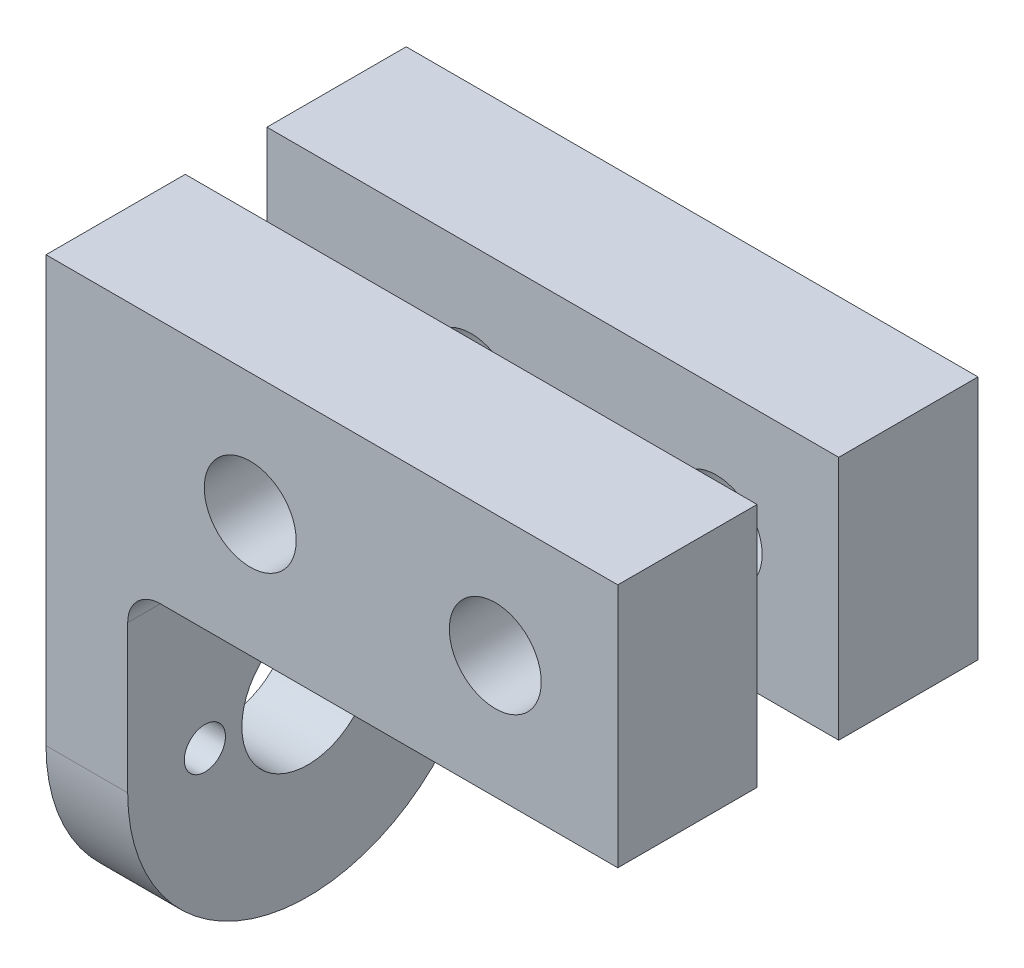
ISO-10303-21;
HEADER;
FILE_DESCRIPTION(('STEP AP214'),'2;1');
FILE_NAME('part.step','',(''),(''),'','','');
FILE_SCHEMA(('AUTOMOTIVE_DESIGN { 1 0 10303 214 1 1 1 1 }'));
ENDSEC;
DATA;
#1=APPLICATION_CONTEXT('core data for automotive mechanical design processes');
#2=APPLICATION_PROTOCOL_DEFINITION('international standard','automotive_design',2000,#1);
#3=PRODUCT_CONTEXT('',#1,'mechanical');
#4=PRODUCT('Part','Part','',(#3));
#5=PRODUCT_RELATED_PRODUCT_CATEGORY('part','',(#4));
#6=PRODUCT_DEFINITION_FORMATION('','',#4);
#7=PRODUCT_DEFINITION_CONTEXT('part definition',#1,'design');
#8=PRODUCT_DEFINITION('design','',#6,#7);
#9=PRODUCT_DEFINITION_SHAPE('','',#8);
#10=(LENGTH_UNIT() NAMED_UNIT(*) SI_UNIT(.MILLI.,.METRE.));
#11=(NAMED_UNIT(*) PLANE_ANGLE_UNIT() SI_UNIT($,.RADIAN.));
#12=(NAMED_UNIT(*) SI_UNIT($,.STERADIAN.) SOLID_ANGLE_UNIT());
#13=UNCERTAINTY_MEASURE_WITH_UNIT(LENGTH_MEASURE(1.E-05),#10,'distance_accuracy_value','');
#14=(GEOMETRIC_REPRESENTATION_CONTEXT(3) GLOBAL_UNCERTAINTY_ASSIGNED_CONTEXT((#13)) GLOBAL_UNIT_ASSIGNED_CONTEXT((#10,
#11,#12)) REPRESENTATION_CONTEXT('',''));
#15=CARTESIAN_POINT('',(0.,0.,0.));
#16=DIRECTION('',(0.,0.,1.));
#17=DIRECTION('',(1.,0.,0.));
#18=AXIS2_PLACEMENT_3D('',#15,#16,#17);
#19=CARTESIAN_POINT('',(-38.1,-9.525,0.));
#20=DIRECTION('',(0.,-1.,0.));
#21=DIRECTION('',(0.,0.,-1.));
#22=AXIS2_PLACEMENT_3D('',#19,#20,#21);
#23=PLANE('',#22);
#24=DIRECTION('',(1.,0.,0.));
#25=VECTOR('',#24,1.);
#26=CARTESIAN_POINT('',(-38.1,-9.525,14.));
#27=LINE('',#26,#25);
#28=CARTESIAN_POINT('',(-35.56,-9.525,14.));
#29=VERTEX_POINT('',#28);
#30=CARTESIAN_POINT('',(0.,-9.525,14.));
#31=VERTEX_POINT('',#30);
#32=EDGE_CURVE('E295',#29,#31,#27,.T.);
#33=ORIENTED_EDGE('',*,*,#32,.F.);
#34=DIRECTION('',(0.,0.,-1.));
#35=VECTOR('',#34,1.);
#36=CARTESIAN_POINT('',(-35.56,-9.525,0.));
#37=LINE('',#36,#35);
#38=CARTESIAN_POINT('',(-35.56,-9.525,3.175));
#39=VERTEX_POINT('',#38);
#40=EDGE_CURVE('E328',#29,#39,#37,.T.);
#41=ORIENTED_EDGE('',*,*,#40,.T.);
#42=DIRECTION('',(1.,0.,0.));
#43=VECTOR('',#42,1.);
#44=CARTESIAN_POINT('',(-38.1,-9.525,3.175));
#45=LINE('',#44,#43);
#46=CARTESIAN_POINT('',(0.,-9.525,3.175));
#47=VERTEX_POINT('',#46);
#48=EDGE_CURVE('E294',#39,#47,#45,.T.);
#49=ORIENTED_EDGE('',*,*,#48,.T.);
#50=DIRECTION('',(0.,0.,-1.));
#51=VECTOR('',#50,1.);
#52=CARTESIAN_POINT('',(0.,-9.525,0.));
#53=LINE('',#52,#51);
#54=EDGE_CURVE('E279',#31,#47,#53,.T.);
#55=ORIENTED_EDGE('',*,*,#54,.F.);
#56=EDGE_LOOP('',(#33,#41,#49,#55));
#57=FACE_BOUND('',#56,.T.);
#58=ADVANCED_FACE('F41',(#57),#23,.T.);
#59=CARTESIAN_POINT('',(-38.1,0.,14.));
#60=DIRECTION('',(0.,0.,-1.));
#61=DIRECTION('',(-1.,0.,0.));
#62=AXIS2_PLACEMENT_3D('',#59,#60,#61);
#63=PLANE('',#62);
#64=CARTESIAN_POINT('',(-28.575,0.,14.));
#65=DIRECTION('',(0.,0.,-1.));
#66=DIRECTION('',(-1.,0.,0.));
#67=AXIS2_PLACEMENT_3D('',#64,#65,#66);
#68=CIRCLE('',#67,3.571875);
#69=CARTESIAN_POINT('',(-25.003125,0.,14.));
#70=VERTEX_POINT('',#69);
#71=EDGE_CURVE('E275',#70,#70,#68,.T.);
#72=ORIENTED_EDGE('',*,*,#71,.T.);
#73=EDGE_LOOP('',(#72));
#74=FACE_BOUND('',#73,.T.);
#75=CARTESIAN_POINT('',(-9.525,0.,14.));
#76=DIRECTION('',(0.,0.,-1.));
#77=DIRECTION('',(-1.,0.,0.));
#78=AXIS2_PLACEMENT_3D('',#75,#76,#77);
#79=CIRCLE('',#78,3.571875);
#80=CARTESIAN_POINT('',(-5.953125,0.,14.));
#81=VERTEX_POINT('',#80);
#82=EDGE_CURVE('E270',#81,#81,#79,.T.);
#83=ORIENTED_EDGE('',*,*,#82,.T.);
#84=EDGE_LOOP('',(#83));
#85=FACE_BOUND('',#84,.T.);
#86=DIRECTION('',(0.,1.,0.));
#87=VECTOR('',#86,1.);
#88=CARTESIAN_POINT('',(0.,0.,14.));
#89=LINE('',#88,#87);
#90=CARTESIAN_POINT('',(0.,9.525,14.));
#91=VERTEX_POINT('',#90);
#92=EDGE_CURVE('E291',#31,#91,#89,.T.);
#93=ORIENTED_EDGE('',*,*,#92,.T.);
#94=DIRECTION('',(1.,0.,0.));
#95=VECTOR('',#94,1.);
#96=CARTESIAN_POINT('',(-38.1,9.525,14.));
#97=LINE('',#96,#95);
#98=CARTESIAN_POINT('',(-44.45,9.525,14.));
#99=VERTEX_POINT('',#98);
#100=EDGE_CURVE('E299',#99,#91,#97,.T.);
#101=ORIENTED_EDGE('',*,*,#100,.F.);
#102=DIRECTION('',(0.,-1.,0.));
#103=VECTOR('',#102,1.);
#104=CARTESIAN_POINT('',(-44.45,0.,14.));
#105=LINE('',#104,#103);
#106=CARTESIAN_POINT('',(-44.45,-23.525,14.));
#107=VERTEX_POINT('',#106);
#108=EDGE_CURVE('E202',#99,#107,#105,.T.);
#109=ORIENTED_EDGE('',*,*,#108,.T.);
#110=DIRECTION('',(1.,0.,0.));
#111=VECTOR('',#110,1.);
#112=CARTESIAN_POINT('',(-44.45,-23.525,14.));
#113=LINE('',#112,#111);
#114=CARTESIAN_POINT('',(-38.1,-23.525,14.));
#115=VERTEX_POINT('',#114);
#116=EDGE_CURVE('E252',#107,#115,#113,.T.);
#117=ORIENTED_EDGE('',*,*,#116,.T.);
#118=DIRECTION('',(0.,-1.,0.));
#119=VECTOR('',#118,1.);
#120=CARTESIAN_POINT('',(-38.1,0.,14.));
#121=LINE('',#120,#119);
#122=CARTESIAN_POINT('',(-38.1,-12.065,14.));
#123=VERTEX_POINT('',#122);
#124=EDGE_CURVE('E235',#123,#115,#121,.T.);
#125=ORIENTED_EDGE('',*,*,#124,.F.);
#126=CARTESIAN_POINT('',(-35.56,-12.065,14.));
#127=DIRECTION('',(0.,0.,-1.));
#128=DIRECTION('',(-1.,0.,0.));
#129=AXIS2_PLACEMENT_3D('',#126,#127,#128);
#130=CIRCLE('',#129,2.54);
#131=EDGE_CURVE('E11',#123,#29,#130,.T.);
#132=ORIENTED_EDGE('',*,*,#131,.T.);
#133=ORIENTED_EDGE('',*,*,#32,.T.);
#134=EDGE_LOOP('',(#93,#101,#109,#117,#125,#132,#133));
#135=FACE_BOUND('',#134,.T.);
#136=ADVANCED_FACE('F348',(#74,#85,#135),#63,.F.);
#137=CARTESIAN_POINT('',(-38.1,9.525,0.));
#138=DIRECTION('',(0.,-1.,0.));
#139=DIRECTION('',(0.,0.,-1.));
#140=AXIS2_PLACEMENT_3D('',#137,#138,#139);
#141=PLANE('',#140);
#142=DIRECTION('',(0.,0.,-1.));
#143=VECTOR('',#142,1.);
#144=CARTESIAN_POINT('',(0.,9.525,0.));
#145=LINE('',#144,#143);
#146=CARTESIAN_POINT('',(0.,9.525,3.175));
#147=VERTEX_POINT('',#146);
#148=EDGE_CURVE('E287',#91,#147,#145,.T.);
#149=ORIENTED_EDGE('',*,*,#148,.T.);
#150=DIRECTION('',(1.,0.,0.));
#151=VECTOR('',#150,1.);
#152=CARTESIAN_POINT('',(-38.1,9.525,3.175));
#153=LINE('',#152,#151);
#154=CARTESIAN_POINT('',(-44.45,9.525,3.175));
#155=VERTEX_POINT('',#154);
#156=EDGE_CURVE('E303',#155,#147,#153,.T.);
#157=ORIENTED_EDGE('',*,*,#156,.F.);
#158=DIRECTION('',(0.,0.,-1.));
#159=VECTOR('',#158,1.);
#160=CARTESIAN_POINT('',(-44.45,9.525,0.));
#161=LINE('',#160,#159);
#162=EDGE_CURVE('E206',#99,#155,#161,.T.);
#163=ORIENTED_EDGE('',*,*,#162,.F.);
#164=ORIENTED_EDGE('',*,*,#100,.T.);
#165=EDGE_LOOP('',(#149,#157,#163,#164));
#166=FACE_BOUND('',#165,.T.);
#167=ADVANCED_FACE('F357',(#166),#141,.F.);
#168=CARTESIAN_POINT('',(-38.1,0.,3.175));
#169=DIRECTION('',(0.,0.,-1.));
#170=DIRECTION('',(-1.,0.,0.));
#171=AXIS2_PLACEMENT_3D('',#168,#169,#170);
#172=PLANE('',#171);
#173=CARTESIAN_POINT('',(-28.575,0.,3.175));
#174=DIRECTION('',(0.,0.,-1.));
#175=DIRECTION('',(-1.,0.,0.));
#176=AXIS2_PLACEMENT_3D('',#173,#174,#175);
#177=CIRCLE('',#176,3.571875);
#178=CARTESIAN_POINT('',(-25.003125,0.,3.175));
#179=VERTEX_POINT('',#178);
#180=EDGE_CURVE('E274',#179,#179,#177,.T.);
#181=ORIENTED_EDGE('',*,*,#180,.F.);
#182=EDGE_LOOP('',(#181));
#183=FACE_BOUND('',#182,.T.);
#184=CARTESIAN_POINT('',(-9.525,0.,3.175));
#185=DIRECTION('',(0.,0.,-1.));
#186=DIRECTION('',(-1.,0.,0.));
#187=AXIS2_PLACEMENT_3D('',#184,#185,#186);
#188=CIRCLE('',#187,3.571875);
#189=CARTESIAN_POINT('',(-5.953125,0.,3.175));
#190=VERTEX_POINT('',#189);
#191=EDGE_CURVE('E269',#190,#190,#188,.T.);
#192=ORIENTED_EDGE('',*,*,#191,.F.);
#193=EDGE_LOOP('',(#192));
#194=FACE_BOUND('',#193,.T.);
#195=DIRECTION('',(0.,1.,0.));
#196=VECTOR('',#195,1.);
#197=CARTESIAN_POINT('',(0.,0.,3.175));
#198=LINE('',#197,#196);
#199=EDGE_CURVE('E283',#47,#147,#198,.T.);
#200=ORIENTED_EDGE('',*,*,#199,.F.);
#201=ORIENTED_EDGE('',*,*,#48,.F.);
#202=CARTESIAN_POINT('',(-35.56,-12.065,3.175));
#203=DIRECTION('',(0.,0.,-1.));
#204=DIRECTION('',(-1.,0.,0.));
#205=AXIS2_PLACEMENT_3D('',#202,#203,#204);
#206=CIRCLE('',#205,2.54);
#207=CARTESIAN_POINT('',(-38.1,-12.065,3.175));
#208=VERTEX_POINT('',#207);
#209=EDGE_CURVE('E50',#39,#208,#206,.F.);
#210=ORIENTED_EDGE('',*,*,#209,.T.);
#211=DIRECTION('',(0.,-1.,0.));
#212=VECTOR('',#211,1.);
#213=CARTESIAN_POINT('',(-38.1,0.,3.175));
#214=LINE('',#213,#212);
#215=CARTESIAN_POINT('',(-38.1,-9.525,3.175));
#216=VERTEX_POINT('',#215);
#217=EDGE_CURVE('E57',#216,#208,#214,.T.);
#218=ORIENTED_EDGE('',*,*,#217,.F.);
#219=DIRECTION('',(1.,0.,0.));
#220=VECTOR('',#219,1.);
#221=CARTESIAN_POINT('',(-44.45,-9.525,3.175));
#222=LINE('',#221,#220);
#223=CARTESIAN_POINT('',(-44.45,-9.525,3.175));
#224=VERTEX_POINT('',#223);
#225=EDGE_CURVE('E225',#224,#216,#222,.T.);
#226=ORIENTED_EDGE('',*,*,#225,.F.);
#227=DIRECTION('',(0.,-1.,0.));
#228=VECTOR('',#227,1.);
#229=CARTESIAN_POINT('',(-44.45,0.,3.175));
#230=LINE('',#229,#228);
#231=EDGE_CURVE('E210',#155,#224,#230,.T.);
#232=ORIENTED_EDGE('',*,*,#231,.F.);
#233=ORIENTED_EDGE('',*,*,#156,.T.);
#234=EDGE_LOOP('',(#200,#201,#210,#218,#226,#232,#233));
#235=FACE_BOUND('',#234,.T.);
#236=ADVANCED_FACE('F338',(#183,#194,#235),#172,.T.);
#237=CARTESIAN_POINT('',(0.,0.,0.));
#238=DIRECTION('',(1.,0.,0.));
#239=DIRECTION('',(0.,0.,-1.));
#240=AXIS2_PLACEMENT_3D('',#237,#238,#239);
#241=PLANE('',#240);
#242=ORIENTED_EDGE('',*,*,#54,.T.);
#243=ORIENTED_EDGE('',*,*,#199,.T.);
#244=ORIENTED_EDGE('',*,*,#148,.F.);
#245=ORIENTED_EDGE('',*,*,#92,.F.);
#246=EDGE_LOOP('',(#242,#243,#244,#245));
#247=FACE_BOUND('',#246,.T.);
#248=ADVANCED_FACE('F353',(#247),#241,.T.);
#249=CARTESIAN_POINT('',(-9.525,0.,-14.));
#250=DIRECTION('',(0.,0.,1.));
#251=DIRECTION('',(1.,0.,0.));
#252=AXIS2_PLACEMENT_3D('',#249,#250,#251);
#253=CYLINDRICAL_SURFACE('',#252,3.571875);
#254=CARTESIAN_POINT('',(-5.953125,0.,3.175));
#255=CARTESIAN_POINT('',(-5.953125,0.,3.28776041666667));
#256=CARTESIAN_POINT('',(-5.953125,0.,3.40052083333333));
#257=CARTESIAN_POINT('',(-5.953125,0.,3.62604166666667));
#258=CARTESIAN_POINT('',(-5.953125,0.,3.73880208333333));
#259=CARTESIAN_POINT('',(-5.953125,0.,3.96432291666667));
#260=CARTESIAN_POINT('',(-5.953125,0.,4.07708333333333));
#261=CARTESIAN_POINT('',(-5.953125,0.,4.30260416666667));
#262=CARTESIAN_POINT('',(-5.953125,0.,4.41536458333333));
#263=CARTESIAN_POINT('',(-5.953125,0.,4.64088541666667));
#264=CARTESIAN_POINT('',(-5.953125,0.,4.75364583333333));
#265=CARTESIAN_POINT('',(-5.953125,0.,4.97916666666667));
#266=CARTESIAN_POINT('',(-5.953125,0.,5.09192708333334));
#267=CARTESIAN_POINT('',(-5.953125,0.,5.31744791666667));
#268=CARTESIAN_POINT('',(-5.953125,0.,5.43020833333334));
#269=CARTESIAN_POINT('',(-5.953125,0.,5.65572916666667));
#270=CARTESIAN_POINT('',(-5.953125,0.,5.76848958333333));
#271=CARTESIAN_POINT('',(-5.953125,0.,5.99401041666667));
#272=CARTESIAN_POINT('',(-5.953125,0.,6.10677083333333));
#273=CARTESIAN_POINT('',(-5.953125,0.,6.33229166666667));
#274=CARTESIAN_POINT('',(-5.953125,0.,6.44505208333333));
#275=CARTESIAN_POINT('',(-5.953125,0.,6.67057291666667));
#276=CARTESIAN_POINT('',(-5.953125,0.,6.78333333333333));
#277=CARTESIAN_POINT('',(-5.953125,0.,7.00885416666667));
#278=CARTESIAN_POINT('',(-5.953125,0.,7.12161458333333));
#279=CARTESIAN_POINT('',(-5.953125,0.,7.34713541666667));
#280=CARTESIAN_POINT('',(-5.953125,0.,7.45989583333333));
#281=CARTESIAN_POINT('',(-5.953125,0.,7.68541666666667));
#282=CARTESIAN_POINT('',(-5.953125,0.,7.79817708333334));
#283=CARTESIAN_POINT('',(-5.953125,0.,8.02369791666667));
#284=CARTESIAN_POINT('',(-5.953125,0.,8.13645833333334));
#285=CARTESIAN_POINT('',(-5.953125,0.,8.36197916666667));
#286=CARTESIAN_POINT('',(-5.953125,0.,8.47473958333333));
#287=CARTESIAN_POINT('',(-5.953125,0.,8.70026041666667));
#288=CARTESIAN_POINT('',(-5.953125,0.,8.81302083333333));
#289=CARTESIAN_POINT('',(-5.953125,0.,9.03854166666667));
#290=CARTESIAN_POINT('',(-5.953125,0.,9.15130208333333));
#291=CARTESIAN_POINT('',(-5.953125,0.,9.37682291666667));
#292=CARTESIAN_POINT('',(-5.953125,0.,9.48958333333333));
#293=CARTESIAN_POINT('',(-5.953125,0.,9.71510416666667));
#294=CARTESIAN_POINT('',(-5.953125,0.,9.82786458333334));
#295=CARTESIAN_POINT('',(-5.953125,0.,10.0533854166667));
#296=CARTESIAN_POINT('',(-5.953125,0.,10.1661458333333));
#297=CARTESIAN_POINT('',(-5.953125,0.,10.3916666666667));
#298=CARTESIAN_POINT('',(-5.953125,0.,10.5044270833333));
#299=CARTESIAN_POINT('',(-5.953125,0.,10.7299479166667));
#300=CARTESIAN_POINT('',(-5.953125,0.,10.8427083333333));
#301=CARTESIAN_POINT('',(-5.953125,0.,11.0682291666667));
#302=CARTESIAN_POINT('',(-5.953125,0.,11.1809895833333));
#303=CARTESIAN_POINT('',(-5.953125,0.,11.4065104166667));
#304=CARTESIAN_POINT('',(-5.953125,0.,11.5192708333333));
#305=CARTESIAN_POINT('',(-5.953125,0.,11.7447916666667));
#306=CARTESIAN_POINT('',(-5.953125,0.,11.8575520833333));
#307=CARTESIAN_POINT('',(-5.953125,0.,12.0830729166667));
#308=CARTESIAN_POINT('',(-5.953125,0.,12.1958333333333));
#309=CARTESIAN_POINT('',(-5.953125,0.,12.4213541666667));
#310=CARTESIAN_POINT('',(-5.953125,0.,12.5341145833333));
#311=CARTESIAN_POINT('',(-5.953125,0.,12.7596354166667));
#312=CARTESIAN_POINT('',(-5.953125,0.,12.8723958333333));
#313=CARTESIAN_POINT('',(-5.953125,0.,13.0979166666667));
#314=CARTESIAN_POINT('',(-5.953125,0.,13.2106770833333));
#315=CARTESIAN_POINT('',(-5.953125,0.,13.4361979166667));
#316=CARTESIAN_POINT('',(-5.953125,0.,13.5489583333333));
#317=CARTESIAN_POINT('',(-5.953125,0.,13.7744791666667));
#318=CARTESIAN_POINT('',(-5.953125,0.,13.8872395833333));
#319=CARTESIAN_POINT('',(-5.953125,0.,14.));
#320=B_SPLINE_CURVE_WITH_KNOTS('',3,(#254,#255,#256,#257,#258,#259,#260,#261,#262,#263,#264,
#265,#266,#267,#268,#269,#270,#271,#272,#273,#274,#275,#276,#277,#278,#279,#280,#281,#282,#283,
#284,#285,#286,#287,#288,#289,#290,#291,#292,#293,#294,#295,#296,#297,#298,#299,#300,#301,#302,
#303,#304,#305,#306,#307,#308,#309,#310,#311,#312,#313,#314,#315,#316,#317,#318,#319),
.UNSPECIFIED.,.F.,.F.,(4,2,2,2,2,2,2,2,2,2,2,2,2,2,2,2,2,2,2,2,2,2,2,2,2,2,2,2,2,2,2,2,4),(0.,
0.338281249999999,0.676562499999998,1.01484375,1.353125,1.69140625,2.0296875,2.36796875,2.70625,
3.04453125,3.3828125,3.72109375,4.059375,4.39765625,4.7359375,5.07421875,5.4125,5.75078125,
6.0890625,6.42734375,6.765625,7.10390625,7.4421875,7.78046875,8.11875,8.45703125,8.7953125,
9.13359375,9.471875,9.81015625,10.1484375,10.48671875,10.825),.UNSPECIFIED.);
#321=EDGE_CURVE('BSEAM392',#190,#81,#320,.T.);
#322=ORIENTED_EDGE('',*,*,#191,.T.);
#323=ORIENTED_EDGE('',*,*,#82,.F.);
#324=ORIENTED_EDGE('',*,*,#321,.T.);
#325=ORIENTED_EDGE('',*,*,#321,.F.);
#326=EDGE_LOOP('',(#322,#324,#323,#325));
#327=FACE_BOUND('',#326,.T.);
#328=ADVANCED_FACE('F392',(#327),#253,.F.);
#329=CARTESIAN_POINT('',(-28.575,0.,-14.));
#330=DIRECTION('',(0.,0.,1.));
#331=DIRECTION('',(1.,0.,0.));
#332=AXIS2_PLACEMENT_3D('',#329,#330,#331);
#333=CYLINDRICAL_SURFACE('',#332,3.571875);
#334=CARTESIAN_POINT('',(-25.003125,0.,3.175));
#335=CARTESIAN_POINT('',(-25.003125,0.,3.28776041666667));
#336=CARTESIAN_POINT('',(-25.003125,0.,3.40052083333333));
#337=CARTESIAN_POINT('',(-25.003125,0.,3.62604166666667));
#338=CARTESIAN_POINT('',(-25.003125,0.,3.73880208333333));
#339=CARTESIAN_POINT('',(-25.003125,0.,3.96432291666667));
#340=CARTESIAN_POINT('',(-25.003125,0.,4.07708333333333));
#341=CARTESIAN_POINT('',(-25.003125,0.,4.30260416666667));
#342=CARTESIAN_POINT('',(-25.003125,0.,4.41536458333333));
#343=CARTESIAN_POINT('',(-25.003125,0.,4.64088541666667));
#344=CARTESIAN_POINT('',(-25.003125,0.,4.75364583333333));
#345=CARTESIAN_POINT('',(-25.003125,0.,4.97916666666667));
#346=CARTESIAN_POINT('',(-25.003125,0.,5.09192708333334));
#347=CARTESIAN_POINT('',(-25.003125,0.,5.31744791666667));
#348=CARTESIAN_POINT('',(-25.003125,0.,5.43020833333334));
#349=CARTESIAN_POINT('',(-25.003125,0.,5.65572916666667));
#350=CARTESIAN_POINT('',(-25.003125,0.,5.76848958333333));
#351=CARTESIAN_POINT('',(-25.003125,0.,5.99401041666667));
#352=CARTESIAN_POINT('',(-25.003125,0.,6.10677083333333));
#353=CARTESIAN_POINT('',(-25.003125,0.,6.33229166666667));
#354=CARTESIAN_POINT('',(-25.003125,0.,6.44505208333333));
#355=CARTESIAN_POINT('',(-25.003125,0.,6.67057291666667));
#356=CARTESIAN_POINT('',(-25.003125,0.,6.78333333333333));
#357=CARTESIAN_POINT('',(-25.003125,0.,7.00885416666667));
#358=CARTESIAN_POINT('',(-25.003125,0.,7.12161458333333));
#359=CARTESIAN_POINT('',(-25.003125,0.,7.34713541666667));
#360=CARTESIAN_POINT('',(-25.003125,0.,7.45989583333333));
#361=CARTESIAN_POINT('',(-25.003125,0.,7.68541666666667));
#362=CARTESIAN_POINT('',(-25.003125,0.,7.79817708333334));
#363=CARTESIAN_POINT('',(-25.003125,0.,8.02369791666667));
#364=CARTESIAN_POINT('',(-25.003125,0.,8.13645833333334));
#365=CARTESIAN_POINT('',(-25.003125,0.,8.36197916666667));
#366=CARTESIAN_POINT('',(-25.003125,0.,8.47473958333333));
#367=CARTESIAN_POINT('',(-25.003125,0.,8.70026041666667));
#368=CARTESIAN_POINT('',(-25.003125,0.,8.81302083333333));
#369=CARTESIAN_POINT('',(-25.003125,0.,9.03854166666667));
#370=CARTESIAN_POINT('',(-25.003125,0.,9.15130208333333));
#371=CARTESIAN_POINT('',(-25.003125,0.,9.37682291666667));
#372=CARTESIAN_POINT('',(-25.003125,0.,9.48958333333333));
#373=CARTESIAN_POINT('',(-25.003125,0.,9.71510416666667));
#374=CARTESIAN_POINT('',(-25.003125,0.,9.82786458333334));
#375=CARTESIAN_POINT('',(-25.003125,0.,10.0533854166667));
#376=CARTESIAN_POINT('',(-25.003125,0.,10.1661458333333));
#377=CARTESIAN_POINT('',(-25.003125,0.,10.3916666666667));
#378=CARTESIAN_POINT('',(-25.003125,0.,10.5044270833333));
#379=CARTESIAN_POINT('',(-25.003125,0.,10.7299479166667));
#380=CARTESIAN_POINT('',(-25.003125,0.,10.8427083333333));
#381=CARTESIAN_POINT('',(-25.003125,0.,11.0682291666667));
#382=CARTESIAN_POINT('',(-25.003125,0.,11.1809895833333));
#383=CARTESIAN_POINT('',(-25.003125,0.,11.4065104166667));
#384=CARTESIAN_POINT('',(-25.003125,0.,11.5192708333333));
#385=CARTESIAN_POINT('',(-25.003125,0.,11.7447916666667));
#386=CARTESIAN_POINT('',(-25.003125,0.,11.8575520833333));
#387=CARTESIAN_POINT('',(-25.003125,0.,12.0830729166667));
#388=CARTESIAN_POINT('',(-25.003125,0.,12.1958333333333));
#389=CARTESIAN_POINT('',(-25.003125,0.,12.4213541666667));
#390=CARTESIAN_POINT('',(-25.003125,0.,12.5341145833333));
#391=CARTESIAN_POINT('',(-25.003125,0.,12.7596354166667));
#392=CARTESIAN_POINT('',(-25.003125,0.,12.8723958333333));
#393=CARTESIAN_POINT('',(-25.003125,0.,13.0979166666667));
#394=CARTESIAN_POINT('',(-25.003125,0.,13.2106770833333));
#395=CARTESIAN_POINT('',(-25.003125,0.,13.4361979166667));
#396=CARTESIAN_POINT('',(-25.003125,0.,13.5489583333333));
#397=CARTESIAN_POINT('',(-25.003125,0.,13.7744791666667));
#398=CARTESIAN_POINT('',(-25.003125,0.,13.8872395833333));
#399=CARTESIAN_POINT('',(-25.003125,0.,14.));
#400=B_SPLINE_CURVE_WITH_KNOTS('',3,(#334,#335,#336,#337,#338,#339,#340,#341,#342,#343,#344,
#345,#346,#347,#348,#349,#350,#351,#352,#353,#354,#355,#356,#357,#358,#359,#360,#361,#362,#363,
#364,#365,#366,#367,#368,#369,#370,#371,#372,#373,#374,#375,#376,#377,#378,#379,#380,#381,#382,
#383,#384,#385,#386,#387,#388,#389,#390,#391,#392,#393,#394,#395,#396,#397,#398,#399),
.UNSPECIFIED.,.F.,.F.,(4,2,2,2,2,2,2,2,2,2,2,2,2,2,2,2,2,2,2,2,2,2,2,2,2,2,2,2,2,2,2,2,4),(0.,
0.338281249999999,0.676562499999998,1.01484375,1.353125,1.69140625,2.0296875,2.36796875,2.70625,
3.04453125,3.3828125,3.72109375,4.059375,4.39765625,4.7359375,5.07421875,5.4125,5.75078125,
6.0890625,6.42734375,6.765625,7.10390625,7.4421875,7.78046875,8.11875,8.45703125,8.7953125,
9.13359375,9.471875,9.81015625,10.1484375,10.48671875,10.825),.UNSPECIFIED.);
#401=EDGE_CURVE('BSEAM385',#179,#70,#400,.T.);
#402=ORIENTED_EDGE('',*,*,#180,.T.);
#403=ORIENTED_EDGE('',*,*,#71,.F.);
#404=ORIENTED_EDGE('',*,*,#401,.T.);
#405=ORIENTED_EDGE('',*,*,#401,.F.);
#406=EDGE_LOOP('',(#402,#404,#403,#405));
#407=FACE_BOUND('',#406,.T.);
#408=ADVANCED_FACE('F385',(#407),#333,.F.);
#409=CARTESIAN_POINT('',(-44.45,-9.525,0.));
#410=DIRECTION('',(0.,1.,0.));
#411=DIRECTION('',(0.,0.,1.));
#412=AXIS2_PLACEMENT_3D('',#409,#410,#411);
#413=PLANE('',#412);
#414=DIRECTION('',(0.,0.,1.));
#415=VECTOR('',#414,1.);
#416=CARTESIAN_POINT('',(-38.1,-9.525,0.));
#417=LINE('',#416,#415);
#418=CARTESIAN_POINT('',(-38.1,-9.525,-3.175));
#419=VERTEX_POINT('',#418);
#420=EDGE_CURVE('E183',#419,#216,#417,.T.);
#421=ORIENTED_EDGE('',*,*,#420,.F.);
#422=DIRECTION('',(1.,0.,0.));
#423=VECTOR('',#422,1.);
#424=CARTESIAN_POINT('',(-44.45,-9.525,-3.175));
#425=LINE('',#424,#423);
#426=CARTESIAN_POINT('',(-44.45,-9.525,-3.175));
#427=VERTEX_POINT('',#426);
#428=EDGE_CURVE('E266',#427,#419,#425,.T.);
#429=ORIENTED_EDGE('',*,*,#428,.F.);
#430=DIRECTION('',(0.,0.,1.));
#431=VECTOR('',#430,1.);
#432=CARTESIAN_POINT('',(-44.45,-9.525,0.));
#433=LINE('',#432,#431);
#434=EDGE_CURVE('E185',#427,#224,#433,.T.);
#435=ORIENTED_EDGE('',*,*,#434,.T.);
#436=ORIENTED_EDGE('',*,*,#225,.T.);
#437=EDGE_LOOP('',(#421,#429,#435,#436));
#438=FACE_BOUND('',#437,.T.);
#439=ADVANCED_FACE('F383',(#438),#413,.T.);
#440=CARTESIAN_POINT('',(-44.45,0.,-3.175));
#441=DIRECTION('',(0.,0.,-1.));
#442=DIRECTION('',(-1.,0.,0.));
#443=AXIS2_PLACEMENT_3D('',#440,#441,#442);
#444=PLANE('',#443);
#445=ORIENTED_EDGE('',*,*,#428,.T.);
#446=DIRECTION('',(0.,1.,0.));
#447=VECTOR('',#446,1.);
#448=CARTESIAN_POINT('',(-38.1,0.,-3.175));
#449=LINE('',#448,#447);
#450=CARTESIAN_POINT('',(-38.1,-12.065,-3.175));
#451=VERTEX_POINT('',#450);
#452=EDGE_CURVE('E321',#451,#419,#449,.T.);
#453=ORIENTED_EDGE('',*,*,#452,.F.);
#454=CARTESIAN_POINT('',(-35.56,-12.065,-3.175));
#455=DIRECTION('',(0.,0.,-1.));
#456=DIRECTION('',(-1.,0.,0.));
#457=AXIS2_PLACEMENT_3D('',#454,#455,#456);
#458=CIRCLE('',#457,2.54);
#459=CARTESIAN_POINT('',(-35.56,-9.525,-3.175));
#460=VERTEX_POINT('',#459);
#461=EDGE_CURVE('E151',#451,#460,#458,.T.);
#462=ORIENTED_EDGE('',*,*,#461,.T.);
#463=DIRECTION('',(1.,0.,0.));
#464=VECTOR('',#463,1.);
#465=CARTESIAN_POINT('',(-38.1,-9.525,-3.175));
#466=LINE('',#465,#464);
#467=CARTESIAN_POINT('',(0.,-9.525,-3.175));
#468=VERTEX_POINT('',#467);
#469=EDGE_CURVE('E143',#460,#468,#466,.T.);
#470=ORIENTED_EDGE('',*,*,#469,.T.);
#471=DIRECTION('',(0.,1.,0.));
#472=VECTOR('',#471,1.);
#473=CARTESIAN_POINT('',(0.,0.,-3.175));
#474=LINE('',#473,#472);
#475=CARTESIAN_POINT('',(0.,9.525,-3.175));
#476=VERTEX_POINT('',#475);
#477=EDGE_CURVE('E149',#468,#476,#474,.T.);
#478=ORIENTED_EDGE('',*,*,#477,.T.);
#479=DIRECTION('',(1.,0.,0.));
#480=VECTOR('',#479,1.);
#481=CARTESIAN_POINT('',(-44.45,9.525,-3.175));
#482=LINE('',#481,#480);
#483=CARTESIAN_POINT('',(-44.45,9.525,-3.175));
#484=VERTEX_POINT('',#483);
#485=EDGE_CURVE('E263',#484,#476,#482,.T.);
#486=ORIENTED_EDGE('',*,*,#485,.F.);
#487=DIRECTION('',(0.,1.,0.));
#488=VECTOR('',#487,1.);
#489=CARTESIAN_POINT('',(-44.45,0.,-3.175));
#490=LINE('',#489,#488);
#491=EDGE_CURVE('E189',#427,#484,#490,.T.);
#492=ORIENTED_EDGE('',*,*,#491,.F.);
#493=EDGE_LOOP('',(#445,#453,#462,#470,#478,#486,#492));
#494=FACE_BOUND('',#493,.T.);
#495=CARTESIAN_POINT('',(-28.575,0.,-3.175));
#496=DIRECTION('',(0.,0.,-1.));
#497=DIRECTION('',(-1.,0.,0.));
#498=AXIS2_PLACEMENT_3D('',#495,#496,#497);
#499=CIRCLE('',#498,3.571875);
#500=CARTESIAN_POINT('',(-32.146875,0.,-3.175));
#501=VERTEX_POINT('',#500);
#502=EDGE_CURVE('E168',#501,#501,#499,.T.);
#503=ORIENTED_EDGE('',*,*,#502,.T.);
#504=EDGE_LOOP('',(#503));
#505=FACE_BOUND('',#504,.T.);
#506=CARTESIAN_POINT('',(-9.525,0.,-3.175));
#507=DIRECTION('',(0.,0.,-1.));
#508=DIRECTION('',(-1.,0.,0.));
#509=AXIS2_PLACEMENT_3D('',#506,#507,#508);
#510=CIRCLE('',#509,3.571875);
#511=CARTESIAN_POINT('',(-13.096875,0.,-3.175));
#512=VERTEX_POINT('',#511);
#513=EDGE_CURVE('E676',#512,#512,#510,.T.);
#514=ORIENTED_EDGE('',*,*,#513,.T.);
#515=EDGE_LOOP('',(#514));
#516=FACE_BOUND('',#515,.T.);
#517=ADVANCED_FACE('F146',(#494,#505,#516),#444,.F.);
#518=CARTESIAN_POINT('',(-44.45,9.525,0.));
#519=DIRECTION('',(0.,-1.,0.));
#520=DIRECTION('',(0.,0.,-1.));
#521=AXIS2_PLACEMENT_3D('',#518,#519,#520);
#522=PLANE('',#521);
#523=ORIENTED_EDGE('',*,*,#485,.T.);
#524=DIRECTION('',(0.,0.,-1.));
#525=VECTOR('',#524,1.);
#526=CARTESIAN_POINT('',(0.,9.525,0.));
#527=LINE('',#526,#525);
#528=CARTESIAN_POINT('',(0.,9.525,-14.));
#529=VERTEX_POINT('',#528);
#530=EDGE_CURVE('E158',#476,#529,#527,.T.);
#531=ORIENTED_EDGE('',*,*,#530,.T.);
#532=DIRECTION('',(1.,0.,0.));
#533=VECTOR('',#532,1.);
#534=CARTESIAN_POINT('',(-44.45,9.525,-14.));
#535=LINE('',#534,#533);
#536=CARTESIAN_POINT('',(-44.45,9.525,-14.));
#537=VERTEX_POINT('',#536);
#538=EDGE_CURVE('E260',#537,#529,#535,.T.);
#539=ORIENTED_EDGE('',*,*,#538,.F.);
#540=DIRECTION('',(0.,0.,-1.));
#541=VECTOR('',#540,1.);
#542=CARTESIAN_POINT('',(-44.45,9.525,0.));
#543=LINE('',#542,#541);
#544=EDGE_CURVE('E193',#484,#537,#543,.T.);
#545=ORIENTED_EDGE('',*,*,#544,.F.);
#546=EDGE_LOOP('',(#523,#531,#539,#545));
#547=FACE_BOUND('',#546,.T.);
#548=ADVANCED_FACE('F380',(#547),#522,.F.);
#549=CARTESIAN_POINT('',(-44.45,0.,-14.));
#550=DIRECTION('',(0.,0.,1.));
#551=DIRECTION('',(0.,-1.,0.));
#552=AXIS2_PLACEMENT_3D('',#549,#550,#551);
#553=PLANE('',#552);
#554=ORIENTED_EDGE('',*,*,#538,.T.);
#555=DIRECTION('',(0.,1.,0.));
#556=VECTOR('',#555,1.);
#557=CARTESIAN_POINT('',(0.,0.,-14.));
#558=LINE('',#557,#556);
#559=CARTESIAN_POINT('',(0.,-9.525,-14.));
#560=VERTEX_POINT('',#559);
#561=EDGE_CURVE('E174',#560,#529,#558,.T.);
#562=ORIENTED_EDGE('',*,*,#561,.F.);
#563=DIRECTION('',(1.,0.,0.));
#564=VECTOR('',#563,1.);
#565=CARTESIAN_POINT('',(-38.1,-9.525,-14.));
#566=LINE('',#565,#564);
#567=CARTESIAN_POINT('',(-35.56,-9.525,-14.));
#568=VERTEX_POINT('',#567);
#569=EDGE_CURVE('E157',#568,#560,#566,.T.);
#570=ORIENTED_EDGE('',*,*,#569,.F.);
#571=CARTESIAN_POINT('',(-35.56,-12.065,-14.));
#572=DIRECTION('',(0.,0.,1.));
#573=DIRECTION('',(0.,-1.,0.));
#574=AXIS2_PLACEMENT_3D('',#571,#572,#573);
#575=CIRCLE('',#574,2.54);
#576=CARTESIAN_POINT('',(-38.1,-12.065,-14.));
#577=VERTEX_POINT('',#576);
#578=EDGE_CURVE('E331',#568,#577,#575,.T.);
#579=ORIENTED_EDGE('',*,*,#578,.T.);
#580=DIRECTION('',(0.,-1.,0.));
#581=VECTOR('',#580,1.);
#582=CARTESIAN_POINT('',(-38.1,0.,-14.));
#583=LINE('',#582,#581);
#584=CARTESIAN_POINT('',(-38.1,-23.525,-14.));
#585=VERTEX_POINT('',#584);
#586=EDGE_CURVE('E228',#577,#585,#583,.T.);
#587=ORIENTED_EDGE('',*,*,#586,.T.);
#588=DIRECTION('',(1.,0.,0.));
#589=VECTOR('',#588,1.);
#590=CARTESIAN_POINT('',(-44.45,-23.525,-14.));
#591=LINE('',#590,#589);
#592=CARTESIAN_POINT('',(-44.45,-23.525,-14.));
#593=VERTEX_POINT('',#592);
#594=EDGE_CURVE('E256',#593,#585,#591,.T.);
#595=ORIENTED_EDGE('',*,*,#594,.F.);
#596=DIRECTION('',(0.,-1.,0.));
#597=VECTOR('',#596,1.);
#598=CARTESIAN_POINT('',(-44.45,0.,-14.));
#599=LINE('',#598,#597);
#600=EDGE_CURVE('E196',#537,#593,#599,.T.);
#601=ORIENTED_EDGE('',*,*,#600,.F.);
#602=EDGE_LOOP('',(#554,#562,#570,#579,#587,#595,#601));
#603=FACE_BOUND('',#602,.T.);
#604=CARTESIAN_POINT('',(-28.575,0.,-14.));
#605=DIRECTION('',(0.,0.,1.));
#606=DIRECTION('',(1.,0.,0.));
#607=AXIS2_PLACEMENT_3D('',#604,#605,#606);
#608=CIRCLE('',#607,3.571875);
#609=CARTESIAN_POINT('',(-25.003125,0.,-14.));
#610=VERTEX_POINT('',#609);
#611=EDGE_CURVE('E672',#610,#610,#608,.T.);
#612=ORIENTED_EDGE('',*,*,#611,.T.);
#613=EDGE_LOOP('',(#612));
#614=FACE_BOUND('',#613,.T.);
#615=CARTESIAN_POINT('',(-9.525,0.,-14.));
#616=DIRECTION('',(0.,0.,1.));
#617=DIRECTION('',(1.,0.,0.));
#618=AXIS2_PLACEMENT_3D('',#615,#616,#617);
#619=CIRCLE('',#618,3.571875);
#620=CARTESIAN_POINT('',(-5.953125,0.,-14.));
#621=VERTEX_POINT('',#620);
#622=EDGE_CURVE('E681',#621,#621,#619,.T.);
#623=ORIENTED_EDGE('',*,*,#622,.T.);
#624=EDGE_LOOP('',(#623));
#625=FACE_BOUND('',#624,.T.);
#626=ADVANCED_FACE('F374',(#603,#614,#625),#553,.F.);
#627=CARTESIAN_POINT('',(-44.45,-23.525,0.));
#628=DIRECTION('',(1.,0.,0.));
#629=DIRECTION('',(0.,0.,-1.));
#630=AXIS2_PLACEMENT_3D('',#627,#628,#629);
#631=CYLINDRICAL_SURFACE('',#630,14.);
#632=CARTESIAN_POINT('',(-38.1,-23.525,0.));
#633=DIRECTION('',(-1.,0.,0.));
#634=DIRECTION('',(0.,0.,1.));
#635=AXIS2_PLACEMENT_3D('',#632,#633,#634);
#636=CIRCLE('',#635,14.);
#637=EDGE_CURVE('E231',#585,#115,#636,.T.);
#638=ORIENTED_EDGE('',*,*,#637,.T.);
#639=ORIENTED_EDGE('',*,*,#116,.F.);
#640=CARTESIAN_POINT('',(-44.45,-23.525,0.));
#641=DIRECTION('',(-1.,0.,0.));
#642=DIRECTION('',(0.,0.,1.));
#643=AXIS2_PLACEMENT_3D('',#640,#641,#642);
#644=CIRCLE('',#643,14.);
#645=EDGE_CURVE('E199',#593,#107,#644,.T.);
#646=ORIENTED_EDGE('',*,*,#645,.F.);
#647=ORIENTED_EDGE('',*,*,#594,.T.);
#648=EDGE_LOOP('',(#638,#639,#646,#647));
#649=FACE_BOUND('',#648,.T.);
#650=ADVANCED_FACE('F368',(#649),#631,.T.);
#651=CARTESIAN_POINT('',(-44.45,-23.525,-8.));
#652=DIRECTION('',(1.,0.,0.));
#653=DIRECTION('',(0.,0.,-1.));
#654=AXIS2_PLACEMENT_3D('',#651,#652,#653);
#655=CYLINDRICAL_SURFACE('',#654,1.6);
#656=CARTESIAN_POINT('',(-44.45,-23.525,-8.));
#657=DIRECTION('',(-1.,0.,0.));
#658=DIRECTION('',(0.,0.,1.));
#659=AXIS2_PLACEMENT_3D('',#656,#657,#658);
#660=CIRCLE('',#659,1.6);
#661=CARTESIAN_POINT('',(-44.45,-23.525,-6.4));
#662=VERTEX_POINT('',#661);
#663=EDGE_CURVE('E217',#662,#662,#660,.T.);
#664=ORIENTED_EDGE('',*,*,#663,.T.);
#665=EDGE_LOOP('',(#664));
#666=FACE_BOUND('',#665,.T.);
#667=CARTESIAN_POINT('',(-38.1,-23.525,-8.));
#668=DIRECTION('',(-1.,0.,0.));
#669=DIRECTION('',(0.,0.,1.));
#670=AXIS2_PLACEMENT_3D('',#667,#668,#669);
#671=CIRCLE('',#670,1.6);
#672=CARTESIAN_POINT('',(-38.1,-23.525,-6.4));
#673=VERTEX_POINT('',#672);
#674=EDGE_CURVE('E242',#673,#673,#671,.T.);
#675=ORIENTED_EDGE('',*,*,#674,.F.);
#676=EDGE_LOOP('',(#675));
#677=FACE_BOUND('',#676,.T.);
#678=ADVANCED_FACE('F434',(#666,#677),#655,.F.);
#679=CARTESIAN_POINT('',(-44.45,-23.525,0.));
#680=DIRECTION('',(1.,0.,0.));
#681=DIRECTION('',(0.,0.,-1.));
#682=AXIS2_PLACEMENT_3D('',#679,#680,#681);
#683=CYLINDRICAL_SURFACE('',#682,5.125);
#684=CARTESIAN_POINT('',(-44.45,-23.525,0.));
#685=DIRECTION('',(-1.,0.,0.));
#686=DIRECTION('',(0.,0.,1.));
#687=AXIS2_PLACEMENT_3D('',#684,#685,#686);
#688=CIRCLE('',#687,5.125);
#689=CARTESIAN_POINT('',(-44.45,-23.525,5.125));
#690=VERTEX_POINT('',#689);
#691=EDGE_CURVE('E213',#690,#690,#688,.T.);
#692=ORIENTED_EDGE('',*,*,#691,.T.);
#693=EDGE_LOOP('',(#692));
#694=FACE_BOUND('',#693,.T.);
#695=CARTESIAN_POINT('',(-38.1,-23.525,0.));
#696=DIRECTION('',(-1.,0.,0.));
#697=DIRECTION('',(0.,0.,1.));
#698=AXIS2_PLACEMENT_3D('',#695,#696,#697);
#699=CIRCLE('',#698,5.125);
#700=CARTESIAN_POINT('',(-38.1,-23.525,5.125));
#701=VERTEX_POINT('',#700);
#702=EDGE_CURVE('E238',#701,#701,#699,.T.);
#703=ORIENTED_EDGE('',*,*,#702,.F.);
#704=EDGE_LOOP('',(#703));
#705=FACE_BOUND('',#704,.T.);
#706=ADVANCED_FACE('F432',(#694,#705),#683,.F.);
#707=CARTESIAN_POINT('',(-44.45,-23.525,8.));
#708=DIRECTION('',(1.,0.,0.));
#709=DIRECTION('',(0.,0.,-1.));
#710=AXIS2_PLACEMENT_3D('',#707,#708,#709);
#711=CYLINDRICAL_SURFACE('',#710,1.6);
#712=CARTESIAN_POINT('',(-44.45,-23.525,8.));
#713=DIRECTION('',(-1.,0.,0.));
#714=DIRECTION('',(0.,0.,1.));
#715=AXIS2_PLACEMENT_3D('',#712,#713,#714);
#716=CIRCLE('',#715,1.6);
#717=CARTESIAN_POINT('',(-44.45,-23.525,9.6));
#718=VERTEX_POINT('',#717);
#719=EDGE_CURVE('E221',#718,#718,#716,.T.);
#720=ORIENTED_EDGE('',*,*,#719,.T.);
#721=EDGE_LOOP('',(#720));
#722=FACE_BOUND('',#721,.T.);
#723=CARTESIAN_POINT('',(-38.1,-23.525,8.));
#724=DIRECTION('',(-1.,0.,0.));
#725=DIRECTION('',(0.,0.,1.));
#726=AXIS2_PLACEMENT_3D('',#723,#724,#725);
#727=CIRCLE('',#726,1.6);
#728=CARTESIAN_POINT('',(-38.1,-23.525,9.6));
#729=VERTEX_POINT('',#728);
#730=EDGE_CURVE('E190',#729,#729,#727,.T.);
#731=ORIENTED_EDGE('',*,*,#730,.F.);
#732=EDGE_LOOP('',(#731));
#733=FACE_BOUND('',#732,.T.);
#734=ADVANCED_FACE('F427',(#722,#733),#711,.F.);
#735=CARTESIAN_POINT('',(-44.45,0.,0.));
#736=DIRECTION('',(-1.,0.,0.));
#737=DIRECTION('',(0.,0.,1.));
#738=AXIS2_PLACEMENT_3D('',#735,#736,#737);
#739=PLANE('',#738);
#740=ORIENTED_EDGE('',*,*,#434,.F.);
#741=ORIENTED_EDGE('',*,*,#491,.T.);
#742=ORIENTED_EDGE('',*,*,#544,.T.);
#743=ORIENTED_EDGE('',*,*,#600,.T.);
#744=ORIENTED_EDGE('',*,*,#645,.T.);
#745=ORIENTED_EDGE('',*,*,#108,.F.);
#746=ORIENTED_EDGE('',*,*,#162,.T.);
#747=ORIENTED_EDGE('',*,*,#231,.T.);
#748=EDGE_LOOP('',(#740,#741,#742,#743,#744,#745,#746,#747));
#749=FACE_BOUND('',#748,.T.);
#750=ORIENTED_EDGE('',*,*,#691,.F.);
#751=EDGE_LOOP('',(#750));
#752=FACE_BOUND('',#751,.T.);
#753=ORIENTED_EDGE('',*,*,#663,.F.);
#754=EDGE_LOOP('',(#753));
#755=FACE_BOUND('',#754,.T.);
#756=ORIENTED_EDGE('',*,*,#719,.F.);
#757=EDGE_LOOP('',(#756));
#758=FACE_BOUND('',#757,.T.);
#759=ADVANCED_FACE('F362',(#749,#752,#755,#758),#739,.T.);
#760=CARTESIAN_POINT('',(-38.1,0.,0.));
#761=DIRECTION('',(-1.,0.,0.));
#762=DIRECTION('',(0.,0.,1.));
#763=AXIS2_PLACEMENT_3D('',#760,#761,#762);
#764=PLANE('',#763);
#765=ORIENTED_EDGE('',*,*,#586,.F.);
#766=DIRECTION('',(0.,0.,-1.));
#767=VECTOR('',#766,1.);
#768=CARTESIAN_POINT('',(-38.1,-12.065,0.));
#769=LINE('',#768,#767);
#770=EDGE_CURVE('E324',#577,#451,#769,.F.);
#771=ORIENTED_EDGE('',*,*,#770,.T.);
#772=ORIENTED_EDGE('',*,*,#452,.T.);
#773=ORIENTED_EDGE('',*,*,#420,.T.);
#774=ORIENTED_EDGE('',*,*,#217,.T.);
#775=DIRECTION('',(0.,0.,-1.));
#776=VECTOR('',#775,1.);
#777=CARTESIAN_POINT('',(-38.1,-12.065,0.));
#778=LINE('',#777,#776);
#779=EDGE_CURVE('E316',#208,#123,#778,.F.);
#780=ORIENTED_EDGE('',*,*,#779,.T.);
#781=ORIENTED_EDGE('',*,*,#124,.T.);
#782=ORIENTED_EDGE('',*,*,#637,.F.);
#783=EDGE_LOOP('',(#765,#771,#772,#773,#774,#780,#781,#782));
#784=FACE_BOUND('',#783,.T.);
#785=ORIENTED_EDGE('',*,*,#702,.T.);
#786=EDGE_LOOP('',(#785));
#787=FACE_BOUND('',#786,.T.);
#788=ORIENTED_EDGE('',*,*,#674,.T.);
#789=EDGE_LOOP('',(#788));
#790=FACE_BOUND('',#789,.T.);
#791=ORIENTED_EDGE('',*,*,#730,.T.);
#792=EDGE_LOOP('',(#791));
#793=FACE_BOUND('',#792,.T.);
#794=ADVANCED_FACE('F341',(#784,#787,#790,#793),#764,.F.);
#795=CARTESIAN_POINT('',(-38.1,-9.525,0.));
#796=DIRECTION('',(0.,-1.,0.));
#797=DIRECTION('',(0.,0.,-1.));
#798=AXIS2_PLACEMENT_3D('',#795,#796,#797);
#799=PLANE('',#798);
#800=ORIENTED_EDGE('',*,*,#469,.F.);
#801=DIRECTION('',(0.,0.,-1.));
#802=VECTOR('',#801,1.);
#803=CARTESIAN_POINT('',(-35.56,-9.525,0.));
#804=LINE('',#803,#802);
#805=EDGE_CURVE('E298',#460,#568,#804,.T.);
#806=ORIENTED_EDGE('',*,*,#805,.T.);
#807=ORIENTED_EDGE('',*,*,#569,.T.);
#808=DIRECTION('',(0.,0.,-1.));
#809=VECTOR('',#808,1.);
#810=CARTESIAN_POINT('',(0.,-9.525,0.));
#811=LINE('',#810,#809);
#812=EDGE_CURVE('E165',#468,#560,#811,.T.);
#813=ORIENTED_EDGE('',*,*,#812,.F.);
#814=EDGE_LOOP('',(#800,#806,#807,#813));
#815=FACE_BOUND('',#814,.T.);
#816=ADVANCED_FACE('F170',(#815),#799,.T.);
#817=CARTESIAN_POINT('',(0.,0.,0.));
#818=DIRECTION('',(1.,0.,0.));
#819=DIRECTION('',(0.,0.,-1.));
#820=AXIS2_PLACEMENT_3D('',#817,#818,#819);
#821=PLANE('',#820);
#822=ORIENTED_EDGE('',*,*,#477,.F.);
#823=ORIENTED_EDGE('',*,*,#812,.T.);
#824=ORIENTED_EDGE('',*,*,#561,.T.);
#825=ORIENTED_EDGE('',*,*,#530,.F.);
#826=EDGE_LOOP('',(#822,#823,#824,#825));
#827=FACE_BOUND('',#826,.T.);
#828=ADVANCED_FACE('F163',(#827),#821,.T.);
#829=CARTESIAN_POINT('',(-9.525,0.,-14.));
#830=DIRECTION('',(0.,0.,1.));
#831=DIRECTION('',(1.,0.,0.));
#832=AXIS2_PLACEMENT_3D('',#829,#830,#831);
#833=CYLINDRICAL_SURFACE('',#832,3.571875);
#834=ORIENTED_EDGE('',*,*,#622,.F.);
#835=EDGE_LOOP('',(#834));
#836=FACE_BOUND('',#835,.T.);
#837=ORIENTED_EDGE('',*,*,#513,.F.);
#838=EDGE_LOOP('',(#837));
#839=FACE_BOUND('',#838,.T.);
#840=ADVANCED_FACE('F410',(#836,#839),#833,.F.);
#841=CARTESIAN_POINT('',(-28.575,0.,-14.));
#842=DIRECTION('',(0.,0.,1.));
#843=DIRECTION('',(1.,0.,0.));
#844=AXIS2_PLACEMENT_3D('',#841,#842,#843);
#845=CYLINDRICAL_SURFACE('',#844,3.571875);
#846=ORIENTED_EDGE('',*,*,#611,.F.);
#847=EDGE_LOOP('',(#846));
#848=FACE_BOUND('',#847,.T.);
#849=ORIENTED_EDGE('',*,*,#502,.F.);
#850=EDGE_LOOP('',(#849));
#851=FACE_BOUND('',#850,.T.);
#852=ADVANCED_FACE('F405',(#848,#851),#845,.F.);
#853=CARTESIAN_POINT('',(-35.56,-12.065,0.));
#854=DIRECTION('',(0.,0.,-1.));
#855=DIRECTION('',(-1.,0.,0.));
#856=AXIS2_PLACEMENT_3D('',#853,#854,#855);
#857=CYLINDRICAL_SURFACE('',#856,2.54);
#858=ORIENTED_EDGE('',*,*,#461,.F.);
#859=ORIENTED_EDGE('',*,*,#770,.F.);
#860=ORIENTED_EDGE('',*,*,#578,.F.);
#861=ORIENTED_EDGE('',*,*,#805,.F.);
#862=EDGE_LOOP('',(#858,#859,#860,#861));
#863=FACE_BOUND('',#862,.T.);
#864=ADVANCED_FACE('F373',(#863),#857,.F.);
#865=CARTESIAN_POINT('',(-35.56,-12.065,0.));
#866=DIRECTION('',(0.,0.,-1.));
#867=DIRECTION('',(-1.,0.,0.));
#868=AXIS2_PLACEMENT_3D('',#865,#866,#867);
#869=CYLINDRICAL_SURFACE('',#868,2.54);
#870=ORIENTED_EDGE('',*,*,#131,.F.);
#871=ORIENTED_EDGE('',*,*,#779,.F.);
#872=ORIENTED_EDGE('',*,*,#209,.F.);
#873=ORIENTED_EDGE('',*,*,#40,.F.);
#874=EDGE_LOOP('',(#870,#871,#872,#873));
#875=FACE_BOUND('',#874,.T.);
#876=ADVANCED_FACE('F43',(#875),#869,.F.);
#877=CLOSED_SHELL('',(#58,#136,#167,#236,#248,#328,#408,#439,#517,#548,#626,#650,#678,#706,#734,
#759,#794,#816,#828,#840,#852,#864,#876));
#878=MANIFOLD_SOLID_BREP('B2',#877);
#879=ADVANCED_BREP_SHAPE_REPRESENTATION('',(#18,#878),#14);
#880=SHAPE_DEFINITION_REPRESENTATION(#9,#879);
ENDSEC;
END-ISO-10303-21;
